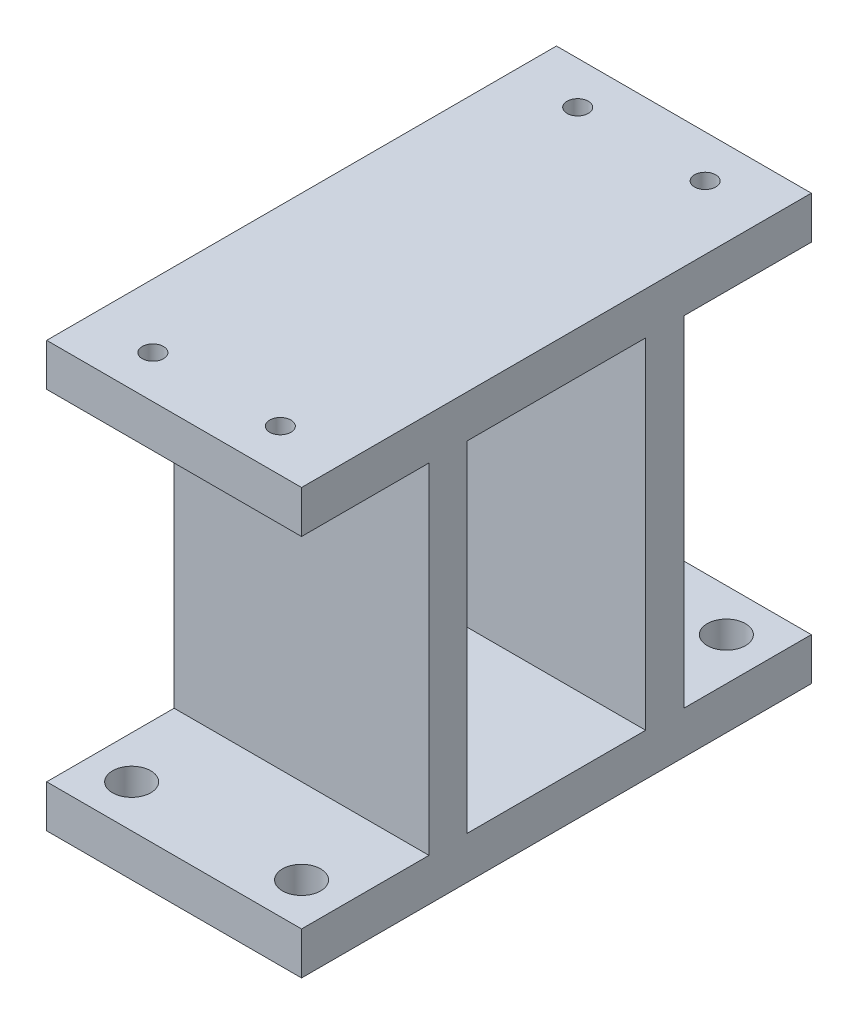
from build123d import *

# Parameters (mm, degrees)
SKETCH1_W                 = 60
SKETCH1_H                 = 120
SKETCH1_R                 = 4.5
BOSS_EXTRUDE1_DEPTH       = 10
SKETCH2_W                 = 60
SKETCH2_H                 = 9
BOSS_EXTRUDE2_DEPTH       = 80
SKETCH3_W                 = 60
SKETCH3_H                 = 9
BOSS_EXTRUDE3_DEPTH       = 80
SKETCH4_W                 = 60
SKETCH4_H                 = 120
BOSS_EXTRUDE4_DEPTH       = 10
M5X0_8_TAPPED_HOLE1_D     = 5
M5X0_8_TAPPED_HOLE1_DEPTH = 10


with BuildPart() as part:
    # Sketch1 → Boss-Extrude1 (new body)
    with BuildSketch(Plane(origin=(0, 0, 0), x_dir=(1, 0, 0), z_dir=(0, 1, 0))):
        with Locations((30, 60)):
            Rectangle(SKETCH1_W, SKETCH1_H)
        with Locations(Location((50, 10, 0), (0, 0, 270))):
            Circle(SKETCH1_R, mode=Mode.SUBTRACT)
        with Locations(Location((50, 110, 0), (0, 0, 270))):
            Circle(SKETCH1_R, mode=Mode.SUBTRACT)
        with Locations(Location((10, 10, 0), (0, 0, 270))):
            Circle(SKETCH1_R, mode=Mode.SUBTRACT)
        with Locations(Location((10, 110, 0), (0, 0, 270))):
            Circle(SKETCH1_R, mode=Mode.SUBTRACT)
    extrude(amount=BOSS_EXTRUDE1_DEPTH)

    # Sketch2 → Boss-Extrude2 (add)
    with BuildSketch(Plane(origin=(0, 10, 0), x_dir=(1, 0, 0), z_dir=(0, 1, 0))):
        with Locations((30, 34.5)):
            Rectangle(SKETCH2_W, SKETCH2_H)
    extrude(amount=BOSS_EXTRUDE2_DEPTH)

    # Sketch3 → Boss-Extrude3 (add)
    with BuildSketch(Plane(origin=(0, 10, 0), x_dir=(1, 0, 0), z_dir=(0, 1, 0))):
        with Locations((30, 85.5)):
            Rectangle(SKETCH3_W, SKETCH3_H)
    extrude(amount=BOSS_EXTRUDE3_DEPTH)

    # Sketch4 → Boss-Extrude4 (add)
    with BuildSketch(Plane(origin=(0, 90, 0), x_dir=(1, 0, 0), z_dir=(0, 1, 0))):
        with Locations((30, 60)):
            Rectangle(SKETCH4_W, SKETCH4_H)
    extrude(amount=BOSS_EXTRUDE4_DEPTH)

    # M5x0.8 Tapped Hole1
    with Locations(Plane(origin=(0, 100, 0), x_dir=(1, 0, 0), z_dir=(0, 1, 0))):
        with Locations((15, 10), (45, 10), (45, 110), (15, 110)):
            Hole(M5X0_8_TAPPED_HOLE1_D / 2, depth=M5X0_8_TAPPED_HOLE1_DEPTH)


solid = part.part
